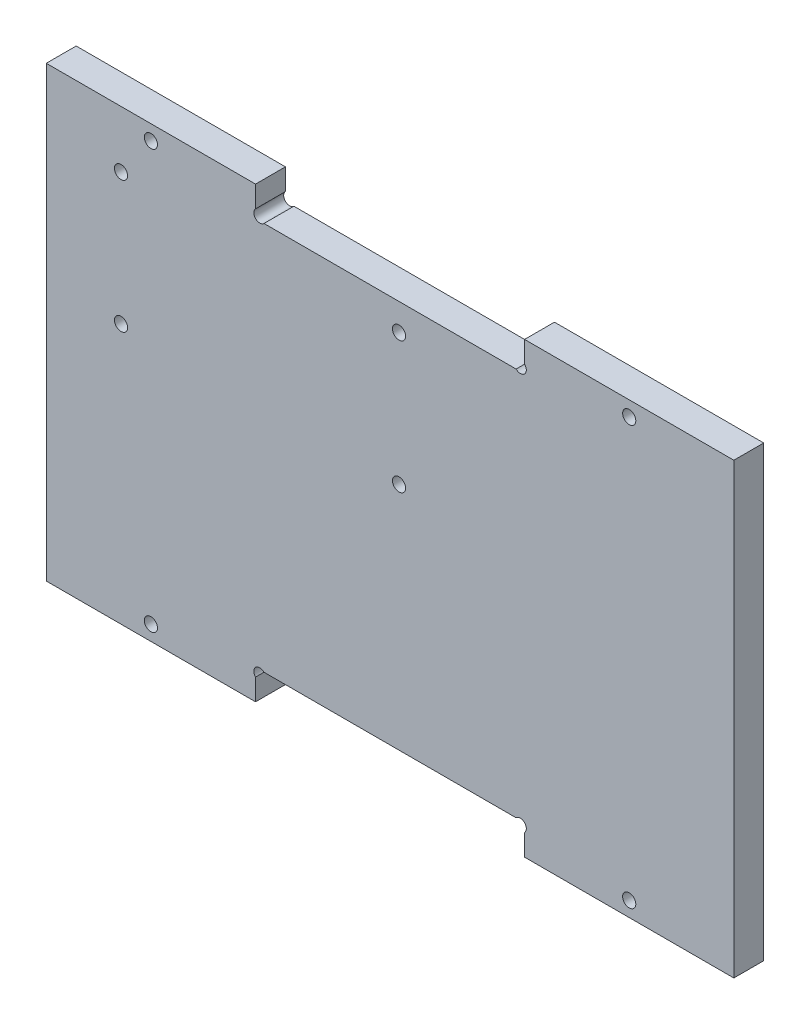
ISO-10303-21;
HEADER;
FILE_DESCRIPTION(('STEP AP214'),'2;1');
FILE_NAME('part.step','',(''),(''),'','','');
FILE_SCHEMA(('AUTOMOTIVE_DESIGN { 1 0 10303 214 1 1 1 1 }'));
ENDSEC;
DATA;
#1=APPLICATION_CONTEXT('core data for automotive mechanical design processes');
#2=APPLICATION_PROTOCOL_DEFINITION('international standard','automotive_design',2000,#1);
#3=PRODUCT_CONTEXT('',#1,'mechanical');
#4=PRODUCT('Part','Part','',(#3));
#5=PRODUCT_RELATED_PRODUCT_CATEGORY('part','',(#4));
#6=PRODUCT_DEFINITION_FORMATION('','',#4);
#7=PRODUCT_DEFINITION_CONTEXT('part definition',#1,'design');
#8=PRODUCT_DEFINITION('design','',#6,#7);
#9=PRODUCT_DEFINITION_SHAPE('','',#8);
#10=(LENGTH_UNIT() NAMED_UNIT(*) SI_UNIT(.MILLI.,.METRE.));
#11=(NAMED_UNIT(*) PLANE_ANGLE_UNIT() SI_UNIT($,.RADIAN.));
#12=(NAMED_UNIT(*) SI_UNIT($,.STERADIAN.) SOLID_ANGLE_UNIT());
#13=UNCERTAINTY_MEASURE_WITH_UNIT(LENGTH_MEASURE(1.E-05),#10,'distance_accuracy_value','');
#14=(GEOMETRIC_REPRESENTATION_CONTEXT(3) GLOBAL_UNCERTAINTY_ASSIGNED_CONTEXT((#13)) GLOBAL_UNIT_ASSIGNED_CONTEXT((#10,
#11,#12)) REPRESENTATION_CONTEXT('',''));
#15=CARTESIAN_POINT('',(0.,0.,0.));
#16=DIRECTION('',(0.,0.,1.));
#17=DIRECTION('',(1.,0.,0.));
#18=AXIS2_PLACEMENT_3D('',#15,#16,#17);
#19=CARTESIAN_POINT('',(0.,75.,5.));
#20=DIRECTION('',(0.,0.,-1.));
#21=DIRECTION('',(-1.,0.,0.));
#22=AXIS2_PLACEMENT_3D('',#19,#20,#21);
#23=PLANE('',#22);
#24=CARTESIAN_POINT('',(97.5,72.5,5.));
#25=DIRECTION('',(0.,0.,-1.));
#26=DIRECTION('',(-1.,0.,0.));
#27=AXIS2_PLACEMENT_3D('',#24,#25,#26);
#28=CIRCLE('',#27,1.1);
#29=CARTESIAN_POINT('',(96.4,72.5,5.));
#30=VERTEX_POINT('',#29);
#31=EDGE_CURVE('E318',#30,#30,#28,.T.);
#32=ORIENTED_EDGE('',*,*,#31,.T.);
#33=EDGE_LOOP('',(#32));
#34=FACE_BOUND('',#33,.T.);
#35=CARTESIAN_POINT('',(17.5,72.5,5.));
#36=DIRECTION('',(0.,0.,-1.));
#37=DIRECTION('',(-1.,0.,0.));
#38=AXIS2_PLACEMENT_3D('',#35,#36,#37);
#39=CIRCLE('',#38,1.1);
#40=CARTESIAN_POINT('',(16.4,72.5,5.));
#41=VERTEX_POINT('',#40);
#42=EDGE_CURVE('E161',#41,#41,#39,.F.);
#43=ORIENTED_EDGE('',*,*,#42,.F.);
#44=EDGE_LOOP('',(#43));
#45=FACE_BOUND('',#44,.T.);
#46=CARTESIAN_POINT('',(35.7071067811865,4.29289321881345,5.));
#47=DIRECTION('',(0.,0.,-1.));
#48=DIRECTION('',(-1.,0.,0.));
#49=AXIS2_PLACEMENT_3D('',#46,#47,#48);
#50=CIRCLE('',#49,0.999999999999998);
#51=CARTESIAN_POINT('',(36.4142135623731,5.,5.));
#52=VERTEX_POINT('',#51);
#53=CARTESIAN_POINT('',(35.,3.5857864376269,5.));
#54=VERTEX_POINT('',#53);
#55=EDGE_CURVE('E47',#52,#54,#50,.F.);
#56=ORIENTED_EDGE('',*,*,#55,.F.);
#57=DIRECTION('',(-1.,0.,0.));
#58=VECTOR('',#57,1.);
#59=CARTESIAN_POINT('',(80.,5.,5.));
#60=LINE('',#59,#58);
#61=CARTESIAN_POINT('',(78.5857864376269,5.,5.));
#62=VERTEX_POINT('',#61);
#63=EDGE_CURVE('E159',#62,#52,#60,.T.);
#64=ORIENTED_EDGE('',*,*,#63,.F.);
#65=CARTESIAN_POINT('',(79.2928932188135,4.29289321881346,5.));
#66=DIRECTION('',(0.,0.,-1.));
#67=DIRECTION('',(-1.,0.,0.));
#68=AXIS2_PLACEMENT_3D('',#65,#66,#67);
#69=CIRCLE('',#68,0.999999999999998);
#70=CARTESIAN_POINT('',(80.,3.58578643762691,5.));
#71=VERTEX_POINT('',#70);
#72=EDGE_CURVE('E55',#71,#62,#69,.F.);
#73=ORIENTED_EDGE('',*,*,#72,.F.);
#74=DIRECTION('',(0.,1.,0.));
#75=VECTOR('',#74,1.);
#76=CARTESIAN_POINT('',(80.,0.,5.));
#77=LINE('',#76,#75);
#78=CARTESIAN_POINT('',(80.,0.,5.));
#79=VERTEX_POINT('',#78);
#80=EDGE_CURVE('E276',#79,#71,#77,.T.);
#81=ORIENTED_EDGE('',*,*,#80,.F.);
#82=DIRECTION('',(1.,0.,0.));
#83=VECTOR('',#82,1.);
#84=CARTESIAN_POINT('',(0.,0.,5.));
#85=LINE('',#84,#83);
#86=CARTESIAN_POINT('',(115.,0.,5.));
#87=VERTEX_POINT('',#86);
#88=EDGE_CURVE('E227',#79,#87,#85,.T.);
#89=ORIENTED_EDGE('',*,*,#88,.T.);
#90=DIRECTION('',(0.,1.,0.));
#91=VECTOR('',#90,1.);
#92=CARTESIAN_POINT('',(115.,0.,5.));
#93=LINE('',#92,#91);
#94=CARTESIAN_POINT('',(115.,75.,5.));
#95=VERTEX_POINT('',#94);
#96=EDGE_CURVE('E232',#87,#95,#93,.T.);
#97=ORIENTED_EDGE('',*,*,#96,.T.);
#98=DIRECTION('',(-1.,0.,0.));
#99=VECTOR('',#98,1.);
#100=CARTESIAN_POINT('',(0.,75.,5.));
#101=LINE('',#100,#99);
#102=CARTESIAN_POINT('',(80.,75.,5.));
#103=VERTEX_POINT('',#102);
#104=EDGE_CURVE('E235',#95,#103,#101,.T.);
#105=ORIENTED_EDGE('',*,*,#104,.T.);
#106=DIRECTION('',(0.,1.,0.));
#107=VECTOR('',#106,1.);
#108=CARTESIAN_POINT('',(80.,75.,5.));
#109=LINE('',#108,#107);
#110=CARTESIAN_POINT('',(80.,71.4142135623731,5.));
#111=VERTEX_POINT('',#110);
#112=EDGE_CURVE('E182',#111,#103,#109,.T.);
#113=ORIENTED_EDGE('',*,*,#112,.F.);
#114=CARTESIAN_POINT('',(79.2928932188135,70.7071067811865,5.));
#115=DIRECTION('',(0.,0.,-1.));
#116=DIRECTION('',(-1.,0.,0.));
#117=AXIS2_PLACEMENT_3D('',#114,#115,#116);
#118=CIRCLE('',#117,0.999999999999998);
#119=CARTESIAN_POINT('',(78.5857864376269,70.,5.));
#120=VERTEX_POINT('',#119);
#121=EDGE_CURVE('E293',#120,#111,#118,.F.);
#122=ORIENTED_EDGE('',*,*,#121,.F.);
#123=DIRECTION('',(1.,0.,0.));
#124=VECTOR('',#123,1.);
#125=CARTESIAN_POINT('',(80.,70.,5.));
#126=LINE('',#125,#124);
#127=CARTESIAN_POINT('',(36.414213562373,70.,5.));
#128=VERTEX_POINT('',#127);
#129=EDGE_CURVE('E194',#128,#120,#126,.T.);
#130=ORIENTED_EDGE('',*,*,#129,.F.);
#131=CARTESIAN_POINT('',(35.7071067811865,70.7071067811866,5.));
#132=DIRECTION('',(0.,0.,-1.));
#133=DIRECTION('',(-1.,0.,0.));
#134=AXIS2_PLACEMENT_3D('',#131,#132,#133);
#135=CIRCLE('',#134,0.999999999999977);
#136=CARTESIAN_POINT('',(35.,71.4142135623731,5.));
#137=VERTEX_POINT('',#136);
#138=EDGE_CURVE('E286',#137,#128,#135,.F.);
#139=ORIENTED_EDGE('',*,*,#138,.F.);
#140=DIRECTION('',(0.,-1.,0.));
#141=VECTOR('',#140,1.);
#142=CARTESIAN_POINT('',(35.,75.,5.));
#143=LINE('',#142,#141);
#144=CARTESIAN_POINT('',(35.,75.,5.));
#145=VERTEX_POINT('',#144);
#146=EDGE_CURVE('E178',#145,#137,#143,.T.);
#147=ORIENTED_EDGE('',*,*,#146,.F.);
#148=CARTESIAN_POINT('',(0.,75.,5.));
#149=VERTEX_POINT('',#148);
#150=EDGE_CURVE('E234',#145,#149,#101,.T.);
#151=ORIENTED_EDGE('',*,*,#150,.T.);
#152=DIRECTION('',(0.,-1.,0.));
#153=VECTOR('',#152,1.);
#154=CARTESIAN_POINT('',(0.,0.,5.));
#155=LINE('',#154,#153);
#156=CARTESIAN_POINT('',(0.,0.,5.));
#157=VERTEX_POINT('',#156);
#158=EDGE_CURVE('E224',#149,#157,#155,.T.);
#159=ORIENTED_EDGE('',*,*,#158,.T.);
#160=CARTESIAN_POINT('',(35.,0.,5.));
#161=VERTEX_POINT('',#160);
#162=EDGE_CURVE('E229',#157,#161,#85,.T.);
#163=ORIENTED_EDGE('',*,*,#162,.T.);
#164=DIRECTION('',(0.,-1.,0.));
#165=VECTOR('',#164,1.);
#166=CARTESIAN_POINT('',(35.,0.,5.));
#167=LINE('',#166,#165);
#168=EDGE_CURVE('E284',#54,#161,#167,.T.);
#169=ORIENTED_EDGE('',*,*,#168,.F.);
#170=EDGE_LOOP('',(#56,#64,#73,#81,#89,#97,#105,#113,#122,#130,#139,#147,#151,#159,#163,#169));
#171=FACE_BOUND('',#170,.T.);
#172=CARTESIAN_POINT('',(12.5,43.5,5.));
#173=DIRECTION('',(0.,0.,1.));
#174=DIRECTION('',(1.,0.,0.));
#175=AXIS2_PLACEMENT_3D('',#172,#173,#174);
#176=CIRCLE('',#175,1.1);
#177=CARTESIAN_POINT('',(13.6,43.5,5.));
#178=VERTEX_POINT('',#177);
#179=EDGE_CURVE('E200',#178,#178,#176,.T.);
#180=ORIENTED_EDGE('',*,*,#179,.F.);
#181=EDGE_LOOP('',(#180));
#182=FACE_BOUND('',#181,.T.);
#183=CARTESIAN_POINT('',(59.,43.5,5.));
#184=DIRECTION('',(0.,0.,1.));
#185=DIRECTION('',(1.,0.,0.));
#186=AXIS2_PLACEMENT_3D('',#183,#184,#185);
#187=CIRCLE('',#186,1.1);
#188=CARTESIAN_POINT('',(60.1,43.5,5.));
#189=VERTEX_POINT('',#188);
#190=EDGE_CURVE('E206',#189,#189,#187,.T.);
#191=ORIENTED_EDGE('',*,*,#190,.F.);
#192=EDGE_LOOP('',(#191));
#193=FACE_BOUND('',#192,.T.);
#194=CARTESIAN_POINT('',(59.,65.5,5.));
#195=DIRECTION('',(0.,0.,1.));
#196=DIRECTION('',(1.,0.,0.));
#197=AXIS2_PLACEMENT_3D('',#194,#195,#196);
#198=CIRCLE('',#197,1.10000000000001);
#199=CARTESIAN_POINT('',(60.1,65.5,5.));
#200=VERTEX_POINT('',#199);
#201=EDGE_CURVE('E212',#200,#200,#198,.T.);
#202=ORIENTED_EDGE('',*,*,#201,.F.);
#203=EDGE_LOOP('',(#202));
#204=FACE_BOUND('',#203,.T.);
#205=CARTESIAN_POINT('',(12.5,65.5,5.));
#206=DIRECTION('',(0.,0.,1.));
#207=DIRECTION('',(1.,0.,0.));
#208=AXIS2_PLACEMENT_3D('',#205,#206,#207);
#209=CIRCLE('',#208,1.1);
#210=CARTESIAN_POINT('',(13.6,65.5,5.));
#211=VERTEX_POINT('',#210);
#212=EDGE_CURVE('E218',#211,#211,#209,.T.);
#213=ORIENTED_EDGE('',*,*,#212,.F.);
#214=EDGE_LOOP('',(#213));
#215=FACE_BOUND('',#214,.T.);
#216=CARTESIAN_POINT('',(97.5,2.5,5.));
#217=DIRECTION('',(0.,0.,-1.));
#218=DIRECTION('',(-1.,0.,0.));
#219=AXIS2_PLACEMENT_3D('',#216,#217,#218);
#220=CIRCLE('',#219,1.1);
#221=CARTESIAN_POINT('',(96.4,2.5,5.));
#222=VERTEX_POINT('',#221);
#223=EDGE_CURVE('E321',#222,#222,#220,.F.);
#224=ORIENTED_EDGE('',*,*,#223,.F.);
#225=EDGE_LOOP('',(#224));
#226=FACE_BOUND('',#225,.T.);
#227=CARTESIAN_POINT('',(17.5,2.5,5.));
#228=DIRECTION('',(0.,0.,-1.));
#229=DIRECTION('',(-1.,0.,0.));
#230=AXIS2_PLACEMENT_3D('',#227,#228,#229);
#231=CIRCLE('',#230,1.1);
#232=CARTESIAN_POINT('',(16.4,2.5,5.));
#233=VERTEX_POINT('',#232);
#234=EDGE_CURVE('E330',#233,#233,#231,.T.);
#235=ORIENTED_EDGE('',*,*,#234,.T.);
#236=EDGE_LOOP('',(#235));
#237=FACE_BOUND('',#236,.T.);
#238=ADVANCED_FACE('F32',(#34,#45,#171,#182,#193,#204,#215,#226,#237),#23,.F.);
#239=CARTESIAN_POINT('',(0.,75.,0.));
#240=DIRECTION('',(0.,0.,-1.));
#241=DIRECTION('',(-1.,0.,0.));
#242=AXIS2_PLACEMENT_3D('',#239,#240,#241);
#243=PLANE('',#242);
#244=CARTESIAN_POINT('',(97.5,72.5,0.));
#245=DIRECTION('',(0.,0.,1.));
#246=DIRECTION('',(1.,0.,0.));
#247=AXIS2_PLACEMENT_3D('',#244,#245,#246);
#248=CIRCLE('',#247,1.1);
#249=CARTESIAN_POINT('',(98.6,72.5,0.));
#250=VERTEX_POINT('',#249);
#251=EDGE_CURVE('E317',#250,#250,#248,.T.);
#252=ORIENTED_EDGE('',*,*,#251,.T.);
#253=EDGE_LOOP('',(#252));
#254=FACE_BOUND('',#253,.T.);
#255=CARTESIAN_POINT('',(17.5,72.5,0.));
#256=DIRECTION('',(0.,0.,-1.));
#257=DIRECTION('',(-1.,0.,0.));
#258=AXIS2_PLACEMENT_3D('',#255,#256,#257);
#259=CIRCLE('',#258,1.1);
#260=CARTESIAN_POINT('',(16.4,72.5,0.));
#261=VERTEX_POINT('',#260);
#262=EDGE_CURVE('E314',#261,#261,#259,.T.);
#263=ORIENTED_EDGE('',*,*,#262,.F.);
#264=EDGE_LOOP('',(#263));
#265=FACE_BOUND('',#264,.T.);
#266=DIRECTION('',(1.,0.,0.));
#267=VECTOR('',#266,1.);
#268=CARTESIAN_POINT('',(80.,5.,0.));
#269=LINE('',#268,#267);
#270=CARTESIAN_POINT('',(36.4142135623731,5.,0.));
#271=VERTEX_POINT('',#270);
#272=CARTESIAN_POINT('',(78.5857864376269,5.,0.));
#273=VERTEX_POINT('',#272);
#274=EDGE_CURVE('E157',#271,#273,#269,.T.);
#275=ORIENTED_EDGE('',*,*,#274,.F.);
#276=CARTESIAN_POINT('',(35.7071067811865,4.29289321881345,0.));
#277=DIRECTION('',(0.,0.,-1.));
#278=DIRECTION('',(-1.,0.,0.));
#279=AXIS2_PLACEMENT_3D('',#276,#277,#278);
#280=CIRCLE('',#279,0.999999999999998);
#281=CARTESIAN_POINT('',(35.,3.5857864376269,0.));
#282=VERTEX_POINT('',#281);
#283=EDGE_CURVE('E144',#282,#271,#280,.T.);
#284=ORIENTED_EDGE('',*,*,#283,.F.);
#285=DIRECTION('',(0.,1.,0.));
#286=VECTOR('',#285,1.);
#287=CARTESIAN_POINT('',(35.,0.,0.));
#288=LINE('',#287,#286);
#289=CARTESIAN_POINT('',(35.,0.,0.));
#290=VERTEX_POINT('',#289);
#291=EDGE_CURVE('E169',#290,#282,#288,.T.);
#292=ORIENTED_EDGE('',*,*,#291,.F.);
#293=DIRECTION('',(1.,0.,0.));
#294=VECTOR('',#293,1.);
#295=CARTESIAN_POINT('',(0.,0.,0.));
#296=LINE('',#295,#294);
#297=CARTESIAN_POINT('',(0.,0.,0.));
#298=VERTEX_POINT('',#297);
#299=EDGE_CURVE('E242',#298,#290,#296,.T.);
#300=ORIENTED_EDGE('',*,*,#299,.F.);
#301=DIRECTION('',(0.,-1.,0.));
#302=VECTOR('',#301,1.);
#303=CARTESIAN_POINT('',(0.,0.,0.));
#304=LINE('',#303,#302);
#305=CARTESIAN_POINT('',(0.,75.,0.));
#306=VERTEX_POINT('',#305);
#307=EDGE_CURVE('E221',#306,#298,#304,.T.);
#308=ORIENTED_EDGE('',*,*,#307,.F.);
#309=DIRECTION('',(-1.,0.,0.));
#310=VECTOR('',#309,1.);
#311=CARTESIAN_POINT('',(0.,75.,0.));
#312=LINE('',#311,#310);
#313=CARTESIAN_POINT('',(35.,75.,0.));
#314=VERTEX_POINT('',#313);
#315=EDGE_CURVE('E247',#314,#306,#312,.T.);
#316=ORIENTED_EDGE('',*,*,#315,.F.);
#317=DIRECTION('',(0.,1.,0.));
#318=VECTOR('',#317,1.);
#319=CARTESIAN_POINT('',(35.,75.,0.));
#320=LINE('',#319,#318);
#321=CARTESIAN_POINT('',(35.,71.4142135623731,0.));
#322=VERTEX_POINT('',#321);
#323=EDGE_CURVE('E189',#322,#314,#320,.T.);
#324=ORIENTED_EDGE('',*,*,#323,.F.);
#325=CARTESIAN_POINT('',(35.7071067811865,70.7071067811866,0.));
#326=DIRECTION('',(0.,0.,-1.));
#327=DIRECTION('',(-1.,0.,0.));
#328=AXIS2_PLACEMENT_3D('',#325,#326,#327);
#329=CIRCLE('',#328,0.999999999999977);
#330=CARTESIAN_POINT('',(36.414213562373,70.,0.));
#331=VERTEX_POINT('',#330);
#332=EDGE_CURVE('E288',#331,#322,#329,.T.);
#333=ORIENTED_EDGE('',*,*,#332,.F.);
#334=DIRECTION('',(-1.,0.,0.));
#335=VECTOR('',#334,1.);
#336=CARTESIAN_POINT('',(80.,70.,0.));
#337=LINE('',#336,#335);
#338=CARTESIAN_POINT('',(78.5857864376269,70.,0.));
#339=VERTEX_POINT('',#338);
#340=EDGE_CURVE('E187',#339,#331,#337,.T.);
#341=ORIENTED_EDGE('',*,*,#340,.F.);
#342=CARTESIAN_POINT('',(79.2928932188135,70.7071067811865,0.));
#343=DIRECTION('',(0.,0.,-1.));
#344=DIRECTION('',(-1.,0.,0.));
#345=AXIS2_PLACEMENT_3D('',#342,#343,#344);
#346=CIRCLE('',#345,0.999999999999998);
#347=CARTESIAN_POINT('',(80.,71.4142135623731,0.));
#348=VERTEX_POINT('',#347);
#349=EDGE_CURVE('E295',#348,#339,#346,.T.);
#350=ORIENTED_EDGE('',*,*,#349,.F.);
#351=DIRECTION('',(0.,-1.,0.));
#352=VECTOR('',#351,1.);
#353=CARTESIAN_POINT('',(80.,75.,0.));
#354=LINE('',#353,#352);
#355=CARTESIAN_POINT('',(80.,75.,0.));
#356=VERTEX_POINT('',#355);
#357=EDGE_CURVE('E184',#356,#348,#354,.T.);
#358=ORIENTED_EDGE('',*,*,#357,.F.);
#359=CARTESIAN_POINT('',(115.,75.,0.));
#360=VERTEX_POINT('',#359);
#361=EDGE_CURVE('E228',#360,#356,#312,.T.);
#362=ORIENTED_EDGE('',*,*,#361,.F.);
#363=DIRECTION('',(0.,1.,0.));
#364=VECTOR('',#363,1.);
#365=CARTESIAN_POINT('',(115.,0.,0.));
#366=LINE('',#365,#364);
#367=CARTESIAN_POINT('',(115.,0.,0.));
#368=VERTEX_POINT('',#367);
#369=EDGE_CURVE('E245',#368,#360,#366,.T.);
#370=ORIENTED_EDGE('',*,*,#369,.F.);
#371=CARTESIAN_POINT('',(80.,0.,0.));
#372=VERTEX_POINT('',#371);
#373=EDGE_CURVE('E241',#372,#368,#296,.T.);
#374=ORIENTED_EDGE('',*,*,#373,.F.);
#375=DIRECTION('',(0.,-1.,0.));
#376=VECTOR('',#375,1.);
#377=CARTESIAN_POINT('',(80.,0.,0.));
#378=LINE('',#377,#376);
#379=CARTESIAN_POINT('',(80.,3.58578643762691,0.));
#380=VERTEX_POINT('',#379);
#381=EDGE_CURVE('E174',#380,#372,#378,.T.);
#382=ORIENTED_EDGE('',*,*,#381,.F.);
#383=CARTESIAN_POINT('',(79.2928932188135,4.29289321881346,0.));
#384=DIRECTION('',(0.,0.,-1.));
#385=DIRECTION('',(-1.,0.,0.));
#386=AXIS2_PLACEMENT_3D('',#383,#384,#385);
#387=CIRCLE('',#386,0.999999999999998);
#388=EDGE_CURVE('E167',#273,#380,#387,.T.);
#389=ORIENTED_EDGE('',*,*,#388,.F.);
#390=EDGE_LOOP('',(#275,#284,#292,#300,#308,#316,#324,#333,#341,#350,#358,#362,#370,#374,#382,#389));
#391=FACE_BOUND('',#390,.T.);
#392=CARTESIAN_POINT('',(12.5,43.5,0.));
#393=DIRECTION('',(0.,0.,-1.));
#394=DIRECTION('',(-1.,0.,0.));
#395=AXIS2_PLACEMENT_3D('',#392,#393,#394);
#396=CIRCLE('',#395,1.1);
#397=CARTESIAN_POINT('',(11.4,43.5,0.));
#398=VERTEX_POINT('',#397);
#399=EDGE_CURVE('E199',#398,#398,#396,.F.);
#400=ORIENTED_EDGE('',*,*,#399,.T.);
#401=EDGE_LOOP('',(#400));
#402=FACE_BOUND('',#401,.T.);
#403=CARTESIAN_POINT('',(59.,43.5,0.));
#404=DIRECTION('',(0.,0.,-1.));
#405=DIRECTION('',(-1.,0.,0.));
#406=AXIS2_PLACEMENT_3D('',#403,#404,#405);
#407=CIRCLE('',#406,1.1);
#408=CARTESIAN_POINT('',(57.9,43.5,0.));
#409=VERTEX_POINT('',#408);
#410=EDGE_CURVE('E203',#409,#409,#407,.F.);
#411=ORIENTED_EDGE('',*,*,#410,.T.);
#412=EDGE_LOOP('',(#411));
#413=FACE_BOUND('',#412,.T.);
#414=CARTESIAN_POINT('',(59.,65.5,0.));
#415=DIRECTION('',(0.,0.,-1.));
#416=DIRECTION('',(-1.,0.,0.));
#417=AXIS2_PLACEMENT_3D('',#414,#415,#416);
#418=CIRCLE('',#417,1.10000000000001);
#419=CARTESIAN_POINT('',(57.9,65.5,0.));
#420=VERTEX_POINT('',#419);
#421=EDGE_CURVE('E209',#420,#420,#418,.F.);
#422=ORIENTED_EDGE('',*,*,#421,.T.);
#423=EDGE_LOOP('',(#422));
#424=FACE_BOUND('',#423,.T.);
#425=CARTESIAN_POINT('',(12.5,65.5,0.));
#426=DIRECTION('',(0.,0.,-1.));
#427=DIRECTION('',(-1.,0.,0.));
#428=AXIS2_PLACEMENT_3D('',#425,#426,#427);
#429=CIRCLE('',#428,1.1);
#430=CARTESIAN_POINT('',(11.4,65.5,0.));
#431=VERTEX_POINT('',#430);
#432=EDGE_CURVE('E215',#431,#431,#429,.F.);
#433=ORIENTED_EDGE('',*,*,#432,.T.);
#434=EDGE_LOOP('',(#433));
#435=FACE_BOUND('',#434,.T.);
#436=CARTESIAN_POINT('',(97.5,2.5,0.));
#437=DIRECTION('',(0.,0.,-1.));
#438=DIRECTION('',(1.,0.,0.));
#439=AXIS2_PLACEMENT_3D('',#436,#437,#438);
#440=CIRCLE('',#439,1.1);
#441=CARTESIAN_POINT('',(98.6,2.5,0.));
#442=VERTEX_POINT('',#441);
#443=EDGE_CURVE('E326',#442,#442,#440,.T.);
#444=ORIENTED_EDGE('',*,*,#443,.F.);
#445=EDGE_LOOP('',(#444));
#446=FACE_BOUND('',#445,.T.);
#447=CARTESIAN_POINT('',(17.5,2.5,0.));
#448=DIRECTION('',(0.,0.,1.));
#449=DIRECTION('',(-1.,0.,0.));
#450=AXIS2_PLACEMENT_3D('',#447,#448,#449);
#451=CIRCLE('',#450,1.1);
#452=CARTESIAN_POINT('',(16.4,2.5,0.));
#453=VERTEX_POINT('',#452);
#454=EDGE_CURVE('E329',#453,#453,#451,.T.);
#455=ORIENTED_EDGE('',*,*,#454,.T.);
#456=EDGE_LOOP('',(#455));
#457=FACE_BOUND('',#456,.T.);
#458=ADVANCED_FACE('F164',(#254,#265,#391,#402,#413,#424,#435,#446,#457),#243,.T.);
#459=CARTESIAN_POINT('',(0.,0.,5.));
#460=DIRECTION('',(0.,1.,0.));
#461=DIRECTION('',(0.,0.,1.));
#462=AXIS2_PLACEMENT_3D('',#459,#460,#461);
#463=PLANE('',#462);
#464=ORIENTED_EDGE('',*,*,#88,.F.);
#465=DIRECTION('',(0.,0.,-1.));
#466=VECTOR('',#465,1.);
#467=CARTESIAN_POINT('',(80.,0.,5.001));
#468=LINE('',#467,#466);
#469=EDGE_CURVE('E168',#79,#372,#468,.T.);
#470=ORIENTED_EDGE('',*,*,#469,.T.);
#471=ORIENTED_EDGE('',*,*,#373,.T.);
#472=DIRECTION('',(0.,0.,-1.));
#473=VECTOR('',#472,1.);
#474=CARTESIAN_POINT('',(115.,0.,5.));
#475=LINE('',#474,#473);
#476=EDGE_CURVE('E40',#87,#368,#475,.T.);
#477=ORIENTED_EDGE('',*,*,#476,.F.);
#478=EDGE_LOOP('',(#464,#470,#471,#477));
#479=FACE_BOUND('',#478,.T.);
#480=ADVANCED_FACE('F277',(#479),#463,.F.);
#481=CARTESIAN_POINT('',(0.,75.,5.));
#482=DIRECTION('',(0.,-1.,0.));
#483=DIRECTION('',(0.,0.,-1.));
#484=AXIS2_PLACEMENT_3D('',#481,#482,#483);
#485=PLANE('',#484);
#486=ORIENTED_EDGE('',*,*,#361,.T.);
#487=DIRECTION('',(0.,0.,-1.));
#488=VECTOR('',#487,1.);
#489=CARTESIAN_POINT('',(80.,75.,5.001));
#490=LINE('',#489,#488);
#491=EDGE_CURVE('E192',#103,#356,#490,.T.);
#492=ORIENTED_EDGE('',*,*,#491,.F.);
#493=ORIENTED_EDGE('',*,*,#104,.F.);
#494=DIRECTION('',(0.,0.,-1.));
#495=VECTOR('',#494,1.);
#496=CARTESIAN_POINT('',(115.,75.,5.));
#497=LINE('',#496,#495);
#498=EDGE_CURVE('E252',#95,#360,#497,.T.);
#499=ORIENTED_EDGE('',*,*,#498,.T.);
#500=EDGE_LOOP('',(#486,#492,#493,#499));
#501=FACE_BOUND('',#500,.T.);
#502=ADVANCED_FACE('F268',(#501),#485,.F.);
#503=CARTESIAN_POINT('',(0.,0.,5.));
#504=DIRECTION('',(1.,0.,0.));
#505=DIRECTION('',(0.,0.,-1.));
#506=AXIS2_PLACEMENT_3D('',#503,#504,#505);
#507=PLANE('',#506);
#508=ORIENTED_EDGE('',*,*,#307,.T.);
#509=DIRECTION('',(0.,0.,-1.));
#510=VECTOR('',#509,1.);
#511=CARTESIAN_POINT('',(0.,0.,5.));
#512=LINE('',#511,#510);
#513=EDGE_CURVE('E11',#157,#298,#512,.T.);
#514=ORIENTED_EDGE('',*,*,#513,.F.);
#515=ORIENTED_EDGE('',*,*,#158,.F.);
#516=DIRECTION('',(0.,0.,-1.));
#517=VECTOR('',#516,1.);
#518=CARTESIAN_POINT('',(0.,75.,5.));
#519=LINE('',#518,#517);
#520=EDGE_CURVE('E238',#149,#306,#519,.T.);
#521=ORIENTED_EDGE('',*,*,#520,.T.);
#522=EDGE_LOOP('',(#508,#514,#515,#521));
#523=FACE_BOUND('',#522,.T.);
#524=ADVANCED_FACE('F34',(#523),#507,.F.);
#525=ORIENTED_EDGE('',*,*,#299,.T.);
#526=DIRECTION('',(0.,0.,-1.));
#527=VECTOR('',#526,1.);
#528=CARTESIAN_POINT('',(35.,0.,5.001));
#529=LINE('',#528,#527);
#530=EDGE_CURVE('E172',#161,#290,#529,.T.);
#531=ORIENTED_EDGE('',*,*,#530,.F.);
#532=ORIENTED_EDGE('',*,*,#162,.F.);
#533=ORIENTED_EDGE('',*,*,#513,.T.);
#534=EDGE_LOOP('',(#525,#531,#532,#533));
#535=FACE_BOUND('',#534,.T.);
#536=ADVANCED_FACE('F362',(#535),#463,.F.);
#537=CARTESIAN_POINT('',(115.,0.,5.));
#538=DIRECTION('',(-1.,0.,0.));
#539=DIRECTION('',(0.,0.,1.));
#540=AXIS2_PLACEMENT_3D('',#537,#538,#539);
#541=PLANE('',#540);
#542=ORIENTED_EDGE('',*,*,#369,.T.);
#543=ORIENTED_EDGE('',*,*,#498,.F.);
#544=ORIENTED_EDGE('',*,*,#96,.F.);
#545=ORIENTED_EDGE('',*,*,#476,.T.);
#546=EDGE_LOOP('',(#542,#543,#544,#545));
#547=FACE_BOUND('',#546,.T.);
#548=ADVANCED_FACE('F259',(#547),#541,.F.);
#549=ORIENTED_EDGE('',*,*,#150,.F.);
#550=DIRECTION('',(0.,0.,-1.));
#551=VECTOR('',#550,1.);
#552=CARTESIAN_POINT('',(35.,75.,5.001));
#553=LINE('',#552,#551);
#554=EDGE_CURVE('E191',#145,#314,#553,.T.);
#555=ORIENTED_EDGE('',*,*,#554,.T.);
#556=ORIENTED_EDGE('',*,*,#315,.T.);
#557=ORIENTED_EDGE('',*,*,#520,.F.);
#558=EDGE_LOOP('',(#549,#555,#556,#557));
#559=FACE_BOUND('',#558,.T.);
#560=ADVANCED_FACE('F357',(#559),#485,.F.);
#561=CARTESIAN_POINT('',(12.5,65.5,-0.00100000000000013));
#562=DIRECTION('',(0.,0.,1.));
#563=DIRECTION('',(1.,0.,0.));
#564=AXIS2_PLACEMENT_3D('',#561,#562,#563);
#565=CYLINDRICAL_SURFACE('',#564,1.1);
#566=ORIENTED_EDGE('',*,*,#432,.F.);
#567=EDGE_LOOP('',(#566));
#568=FACE_BOUND('',#567,.T.);
#569=ORIENTED_EDGE('',*,*,#212,.T.);
#570=EDGE_LOOP('',(#569));
#571=FACE_BOUND('',#570,.T.);
#572=ADVANCED_FACE('F354',(#568,#571),#565,.F.);
#573=CARTESIAN_POINT('',(59.,65.5,-0.00100000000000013));
#574=DIRECTION('',(0.,0.,1.));
#575=DIRECTION('',(1.,0.,0.));
#576=AXIS2_PLACEMENT_3D('',#573,#574,#575);
#577=CYLINDRICAL_SURFACE('',#576,1.10000000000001);
#578=ORIENTED_EDGE('',*,*,#421,.F.);
#579=EDGE_LOOP('',(#578));
#580=FACE_BOUND('',#579,.T.);
#581=ORIENTED_EDGE('',*,*,#201,.T.);
#582=EDGE_LOOP('',(#581));
#583=FACE_BOUND('',#582,.T.);
#584=ADVANCED_FACE('F396',(#580,#583),#577,.F.);
#585=CARTESIAN_POINT('',(59.,43.5,-0.00100000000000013));
#586=DIRECTION('',(0.,0.,1.));
#587=DIRECTION('',(1.,0.,0.));
#588=AXIS2_PLACEMENT_3D('',#585,#586,#587);
#589=CYLINDRICAL_SURFACE('',#588,1.1);
#590=ORIENTED_EDGE('',*,*,#410,.F.);
#591=EDGE_LOOP('',(#590));
#592=FACE_BOUND('',#591,.T.);
#593=ORIENTED_EDGE('',*,*,#190,.T.);
#594=EDGE_LOOP('',(#593));
#595=FACE_BOUND('',#594,.T.);
#596=ADVANCED_FACE('F405',(#592,#595),#589,.F.);
#597=CARTESIAN_POINT('',(12.5,43.5,-0.00100000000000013));
#598=DIRECTION('',(0.,0.,1.));
#599=DIRECTION('',(1.,0.,0.));
#600=AXIS2_PLACEMENT_3D('',#597,#598,#599);
#601=CYLINDRICAL_SURFACE('',#600,1.1);
#602=ORIENTED_EDGE('',*,*,#399,.F.);
#603=EDGE_LOOP('',(#602));
#604=FACE_BOUND('',#603,.T.);
#605=ORIENTED_EDGE('',*,*,#179,.T.);
#606=EDGE_LOOP('',(#605));
#607=FACE_BOUND('',#606,.T.);
#608=ADVANCED_FACE('F414',(#604,#607),#601,.F.);
#609=CARTESIAN_POINT('',(80.,75.,5.001));
#610=DIRECTION('',(1.,0.,0.));
#611=DIRECTION('',(0.,0.,-1.));
#612=AXIS2_PLACEMENT_3D('',#609,#610,#611);
#613=PLANE('',#612);
#614=ORIENTED_EDGE('',*,*,#357,.T.);
#615=DIRECTION('',(0.,0.,-1.));
#616=VECTOR('',#615,1.);
#617=CARTESIAN_POINT('',(80.,71.4142135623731,5.001));
#618=LINE('',#617,#616);
#619=EDGE_CURVE('E308',#111,#348,#618,.T.);
#620=ORIENTED_EDGE('',*,*,#619,.F.);
#621=ORIENTED_EDGE('',*,*,#112,.T.);
#622=ORIENTED_EDGE('',*,*,#491,.T.);
#623=EDGE_LOOP('',(#614,#620,#621,#622));
#624=FACE_BOUND('',#623,.T.);
#625=ADVANCED_FACE('F423',(#624),#613,.F.);
#626=CARTESIAN_POINT('',(35.,75.,5.001));
#627=DIRECTION('',(-1.,0.,0.));
#628=DIRECTION('',(0.,0.,1.));
#629=AXIS2_PLACEMENT_3D('',#626,#627,#628);
#630=PLANE('',#629);
#631=ORIENTED_EDGE('',*,*,#146,.T.);
#632=DIRECTION('',(0.,0.,-1.));
#633=VECTOR('',#632,1.);
#634=CARTESIAN_POINT('',(35.,71.4142135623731,5.001));
#635=LINE('',#634,#633);
#636=EDGE_CURVE('E305',#322,#137,#635,.F.);
#637=ORIENTED_EDGE('',*,*,#636,.F.);
#638=ORIENTED_EDGE('',*,*,#323,.T.);
#639=ORIENTED_EDGE('',*,*,#554,.F.);
#640=EDGE_LOOP('',(#631,#637,#638,#639));
#641=FACE_BOUND('',#640,.T.);
#642=ADVANCED_FACE('F441',(#641),#630,.F.);
#643=CARTESIAN_POINT('',(80.,70.,5.001));
#644=DIRECTION('',(0.,-1.,0.));
#645=DIRECTION('',(0.,0.,-1.));
#646=AXIS2_PLACEMENT_3D('',#643,#644,#645);
#647=PLANE('',#646);
#648=ORIENTED_EDGE('',*,*,#129,.T.);
#649=DIRECTION('',(0.,0.,-1.));
#650=VECTOR('',#649,1.);
#651=CARTESIAN_POINT('',(78.5857864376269,70.,5.001));
#652=LINE('',#651,#650);
#653=EDGE_CURVE('E297',#339,#120,#652,.F.);
#654=ORIENTED_EDGE('',*,*,#653,.F.);
#655=ORIENTED_EDGE('',*,*,#340,.T.);
#656=DIRECTION('',(0.,0.,-1.));
#657=VECTOR('',#656,1.);
#658=CARTESIAN_POINT('',(36.414213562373,70.,5.001));
#659=LINE('',#658,#657);
#660=EDGE_CURVE('E290',#128,#331,#659,.T.);
#661=ORIENTED_EDGE('',*,*,#660,.F.);
#662=EDGE_LOOP('',(#648,#654,#655,#661));
#663=FACE_BOUND('',#662,.T.);
#664=ADVANCED_FACE('F451',(#663),#647,.F.);
#665=CARTESIAN_POINT('',(80.,0.,5.001));
#666=DIRECTION('',(1.,0.,0.));
#667=DIRECTION('',(0.,0.,-1.));
#668=AXIS2_PLACEMENT_3D('',#665,#666,#667);
#669=PLANE('',#668);
#670=ORIENTED_EDGE('',*,*,#80,.T.);
#671=DIRECTION('',(0.,0.,-1.));
#672=VECTOR('',#671,1.);
#673=CARTESIAN_POINT('',(80.,3.58578643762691,5.001));
#674=LINE('',#673,#672);
#675=EDGE_CURVE('E160',#380,#71,#674,.F.);
#676=ORIENTED_EDGE('',*,*,#675,.F.);
#677=ORIENTED_EDGE('',*,*,#381,.T.);
#678=ORIENTED_EDGE('',*,*,#469,.F.);
#679=EDGE_LOOP('',(#670,#676,#677,#678));
#680=FACE_BOUND('',#679,.T.);
#681=ADVANCED_FACE('F279',(#680),#669,.F.);
#682=CARTESIAN_POINT('',(80.,5.,5.001));
#683=DIRECTION('',(0.,1.,0.));
#684=DIRECTION('',(0.,0.,1.));
#685=AXIS2_PLACEMENT_3D('',#682,#683,#684);
#686=PLANE('',#685);
#687=ORIENTED_EDGE('',*,*,#63,.T.);
#688=DIRECTION('',(0.,0.,-1.));
#689=VECTOR('',#688,1.);
#690=CARTESIAN_POINT('',(36.4142135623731,5.,5.001));
#691=LINE('',#690,#689);
#692=EDGE_CURVE('E147',#271,#52,#691,.F.);
#693=ORIENTED_EDGE('',*,*,#692,.F.);
#694=ORIENTED_EDGE('',*,*,#274,.T.);
#695=DIRECTION('',(0.,0.,-1.));
#696=VECTOR('',#695,1.);
#697=CARTESIAN_POINT('',(78.5857864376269,5.,5.001));
#698=LINE('',#697,#696);
#699=EDGE_CURVE('E301',#62,#273,#698,.T.);
#700=ORIENTED_EDGE('',*,*,#699,.F.);
#701=EDGE_LOOP('',(#687,#693,#694,#700));
#702=FACE_BOUND('',#701,.T.);
#703=ADVANCED_FACE('F156',(#702),#686,.F.);
#704=CARTESIAN_POINT('',(35.,0.,5.001));
#705=DIRECTION('',(-1.,0.,0.));
#706=DIRECTION('',(0.,0.,1.));
#707=AXIS2_PLACEMENT_3D('',#704,#705,#706);
#708=PLANE('',#707);
#709=ORIENTED_EDGE('',*,*,#291,.T.);
#710=DIRECTION('',(0.,0.,-1.));
#711=VECTOR('',#710,1.);
#712=CARTESIAN_POINT('',(35.,3.5857864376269,5.001));
#713=LINE('',#712,#711);
#714=EDGE_CURVE('E149',#54,#282,#713,.T.);
#715=ORIENTED_EDGE('',*,*,#714,.F.);
#716=ORIENTED_EDGE('',*,*,#168,.T.);
#717=ORIENTED_EDGE('',*,*,#530,.T.);
#718=EDGE_LOOP('',(#709,#715,#716,#717));
#719=FACE_BOUND('',#718,.T.);
#720=ADVANCED_FACE('F475',(#719),#708,.F.);
#721=CARTESIAN_POINT('',(35.7071067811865,70.7071067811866,5.001));
#722=DIRECTION('',(0.,0.,-1.));
#723=DIRECTION('',(-1.,0.,0.));
#724=AXIS2_PLACEMENT_3D('',#721,#722,#723);
#725=CYLINDRICAL_SURFACE('',#724,0.999999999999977);
#726=ORIENTED_EDGE('',*,*,#332,.T.);
#727=ORIENTED_EDGE('',*,*,#636,.T.);
#728=ORIENTED_EDGE('',*,*,#138,.T.);
#729=ORIENTED_EDGE('',*,*,#660,.T.);
#730=EDGE_LOOP('',(#726,#727,#728,#729));
#731=FACE_BOUND('',#730,.T.);
#732=ADVANCED_FACE('F483',(#731),#725,.F.);
#733=CARTESIAN_POINT('',(79.2928932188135,70.7071067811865,5.001));
#734=DIRECTION('',(0.,0.,-1.));
#735=DIRECTION('',(-1.,0.,0.));
#736=AXIS2_PLACEMENT_3D('',#733,#734,#735);
#737=CYLINDRICAL_SURFACE('',#736,0.999999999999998);
#738=ORIENTED_EDGE('',*,*,#121,.T.);
#739=ORIENTED_EDGE('',*,*,#619,.T.);
#740=ORIENTED_EDGE('',*,*,#349,.T.);
#741=ORIENTED_EDGE('',*,*,#653,.T.);
#742=EDGE_LOOP('',(#738,#739,#740,#741));
#743=FACE_BOUND('',#742,.T.);
#744=ADVANCED_FACE('F492',(#743),#737,.F.);
#745=CARTESIAN_POINT('',(79.2928932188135,4.29289321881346,5.001));
#746=DIRECTION('',(0.,0.,-1.));
#747=DIRECTION('',(-1.,0.,0.));
#748=AXIS2_PLACEMENT_3D('',#745,#746,#747);
#749=CYLINDRICAL_SURFACE('',#748,0.999999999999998);
#750=ORIENTED_EDGE('',*,*,#388,.T.);
#751=ORIENTED_EDGE('',*,*,#675,.T.);
#752=ORIENTED_EDGE('',*,*,#72,.T.);
#753=ORIENTED_EDGE('',*,*,#699,.T.);
#754=EDGE_LOOP('',(#750,#751,#752,#753));
#755=FACE_BOUND('',#754,.T.);
#756=ADVANCED_FACE('F504',(#755),#749,.F.);
#757=CARTESIAN_POINT('',(35.7071067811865,4.29289321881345,5.001));
#758=DIRECTION('',(0.,0.,-1.));
#759=DIRECTION('',(-1.,0.,0.));
#760=AXIS2_PLACEMENT_3D('',#757,#758,#759);
#761=CYLINDRICAL_SURFACE('',#760,0.999999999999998);
#762=ORIENTED_EDGE('',*,*,#283,.T.);
#763=ORIENTED_EDGE('',*,*,#692,.T.);
#764=ORIENTED_EDGE('',*,*,#55,.T.);
#765=ORIENTED_EDGE('',*,*,#714,.T.);
#766=EDGE_LOOP('',(#762,#763,#764,#765));
#767=FACE_BOUND('',#766,.T.);
#768=ADVANCED_FACE('F146',(#767),#761,.F.);
#769=CARTESIAN_POINT('',(17.5,72.5,5.001));
#770=DIRECTION('',(0.,0.,-1.));
#771=DIRECTION('',(-1.,0.,0.));
#772=AXIS2_PLACEMENT_3D('',#769,#770,#771);
#773=CYLINDRICAL_SURFACE('',#772,1.1);
#774=ORIENTED_EDGE('',*,*,#262,.T.);
#775=EDGE_LOOP('',(#774));
#776=FACE_BOUND('',#775,.T.);
#777=ORIENTED_EDGE('',*,*,#42,.T.);
#778=EDGE_LOOP('',(#777));
#779=FACE_BOUND('',#778,.T.);
#780=ADVANCED_FACE('F526',(#776,#779),#773,.F.);
#781=CARTESIAN_POINT('',(97.5,72.5,5.001));
#782=DIRECTION('',(0.,0.,-1.));
#783=DIRECTION('',(-1.,0.,0.));
#784=AXIS2_PLACEMENT_3D('',#781,#782,#783);
#785=CYLINDRICAL_SURFACE('',#784,1.1);
#786=ORIENTED_EDGE('',*,*,#251,.F.);
#787=EDGE_LOOP('',(#786));
#788=FACE_BOUND('',#787,.T.);
#789=ORIENTED_EDGE('',*,*,#31,.F.);
#790=EDGE_LOOP('',(#789));
#791=FACE_BOUND('',#790,.T.);
#792=ADVANCED_FACE('F537',(#788,#791),#785,.F.);
#793=CARTESIAN_POINT('',(97.5,2.5,5.001));
#794=DIRECTION('',(0.,0.,-1.));
#795=DIRECTION('',(-1.,0.,0.));
#796=AXIS2_PLACEMENT_3D('',#793,#794,#795);
#797=CYLINDRICAL_SURFACE('',#796,1.1);
#798=ORIENTED_EDGE('',*,*,#443,.T.);
#799=EDGE_LOOP('',(#798));
#800=FACE_BOUND('',#799,.T.);
#801=ORIENTED_EDGE('',*,*,#223,.T.);
#802=EDGE_LOOP('',(#801));
#803=FACE_BOUND('',#802,.T.);
#804=ADVANCED_FACE('F340',(#800,#803),#797,.F.);
#805=CARTESIAN_POINT('',(17.5,2.5,5.001));
#806=DIRECTION('',(0.,0.,-1.));
#807=DIRECTION('',(-1.,0.,0.));
#808=AXIS2_PLACEMENT_3D('',#805,#806,#807);
#809=CYLINDRICAL_SURFACE('',#808,1.1);
#810=ORIENTED_EDGE('',*,*,#454,.F.);
#811=EDGE_LOOP('',(#810));
#812=FACE_BOUND('',#811,.T.);
#813=ORIENTED_EDGE('',*,*,#234,.F.);
#814=EDGE_LOOP('',(#813));
#815=FACE_BOUND('',#814,.T.);
#816=ADVANCED_FACE('F337',(#812,#815),#809,.F.);
#817=CLOSED_SHELL('',(#238,#458,#480,#502,#524,#536,#548,#560,#572,#584,#596,#608,#625,#642,
#664,#681,#703,#720,#732,#744,#756,#768,#780,#792,#804,#816));
#818=MANIFOLD_SOLID_BREP('B2',#817);
#819=ADVANCED_BREP_SHAPE_REPRESENTATION('',(#18,#818),#14);
#820=SHAPE_DEFINITION_REPRESENTATION(#9,#819);
ENDSEC;
END-ISO-10303-21;
